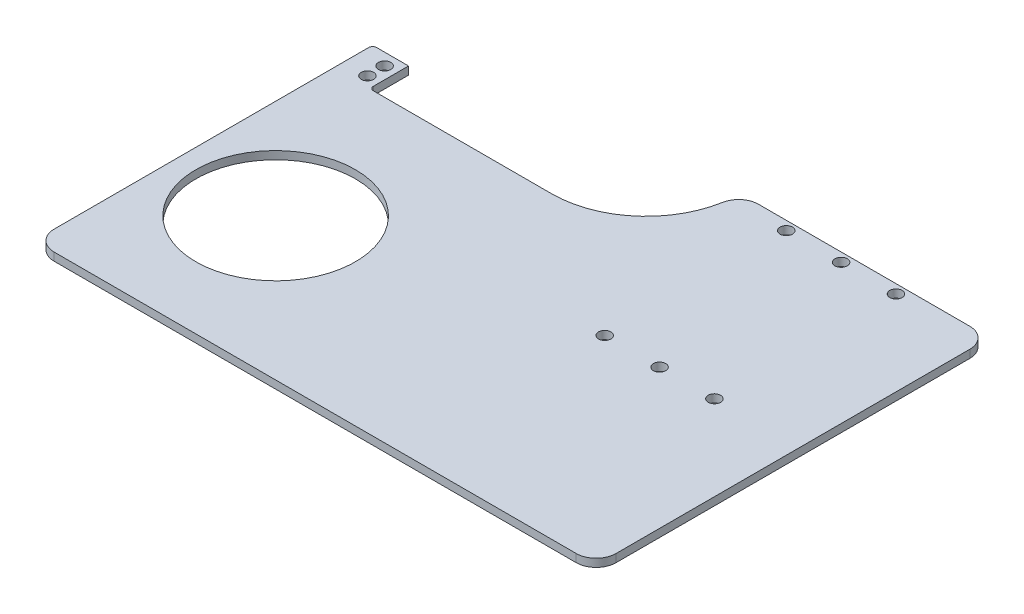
ISO-10303-21;
HEADER;
FILE_DESCRIPTION(('STEP AP214'),'2;1');
FILE_NAME('part.step','',(''),(''),'','','');
FILE_SCHEMA(('AUTOMOTIVE_DESIGN { 1 0 10303 214 1 1 1 1 }'));
ENDSEC;
DATA;
#1=APPLICATION_CONTEXT('core data for automotive mechanical design processes');
#2=APPLICATION_PROTOCOL_DEFINITION('international standard','automotive_design',2000,#1);
#3=PRODUCT_CONTEXT('',#1,'mechanical');
#4=PRODUCT('Part','Part','',(#3));
#5=PRODUCT_RELATED_PRODUCT_CATEGORY('part','',(#4));
#6=PRODUCT_DEFINITION_FORMATION('','',#4);
#7=PRODUCT_DEFINITION_CONTEXT('part definition',#1,'design');
#8=PRODUCT_DEFINITION('design','',#6,#7);
#9=PRODUCT_DEFINITION_SHAPE('','',#8);
#10=(LENGTH_UNIT() NAMED_UNIT(*) SI_UNIT(.MILLI.,.METRE.));
#11=(NAMED_UNIT(*) PLANE_ANGLE_UNIT() SI_UNIT($,.RADIAN.));
#12=(NAMED_UNIT(*) SI_UNIT($,.STERADIAN.) SOLID_ANGLE_UNIT());
#13=UNCERTAINTY_MEASURE_WITH_UNIT(LENGTH_MEASURE(1.E-05),#10,'distance_accuracy_value','');
#14=(GEOMETRIC_REPRESENTATION_CONTEXT(3) GLOBAL_UNCERTAINTY_ASSIGNED_CONTEXT((#13)) GLOBAL_UNIT_ASSIGNED_CONTEXT((#10,
#11,#12)) REPRESENTATION_CONTEXT('',''));
#15=CARTESIAN_POINT('',(0.,0.,0.));
#16=DIRECTION('',(0.,0.,1.));
#17=DIRECTION('',(1.,0.,0.));
#18=AXIS2_PLACEMENT_3D('',#15,#16,#17);
#19=CARTESIAN_POINT('',(0.,0.,0.));
#20=DIRECTION('',(0.,-1.,0.));
#21=DIRECTION('',(0.,0.,-1.));
#22=AXIS2_PLACEMENT_3D('',#19,#20,#21);
#23=PLANE('',#22);
#24=CARTESIAN_POINT('',(-5.10376942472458,0.,-14.));
#25=DIRECTION('',(0.,-1.,0.));
#26=DIRECTION('',(0.,0.,-1.));
#27=AXIS2_PLACEMENT_3D('',#24,#25,#26);
#28=CIRCLE('',#27,40.);
#29=CARTESIAN_POINT('',(-5.10376942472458,0.,-54.));
#30=VERTEX_POINT('',#29);
#31=EDGE_CURVE('E365',#30,#30,#28,.F.);
#32=ORIENTED_EDGE('',*,*,#31,.T.);
#33=EDGE_LOOP('',(#32));
#34=FACE_BOUND('',#33,.T.);
#35=CARTESIAN_POINT('',(129.342262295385,0.,-44.5));
#36=DIRECTION('',(0.,-1.,0.));
#37=DIRECTION('',(0.,0.,-1.));
#38=AXIS2_PLACEMENT_3D('',#35,#36,#37);
#39=CIRCLE('',#38,3.09999999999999);
#40=CARTESIAN_POINT('',(129.342262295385,0.,-47.6));
#41=VERTEX_POINT('',#40);
#42=EDGE_CURVE('E369',#41,#41,#39,.F.);
#43=ORIENTED_EDGE('',*,*,#42,.T.);
#44=EDGE_LOOP('',(#43));
#45=FACE_BOUND('',#44,.T.);
#46=CARTESIAN_POINT('',(156.842262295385,0.,-44.5));
#47=DIRECTION('',(0.,-1.,0.));
#48=DIRECTION('',(0.,0.,-1.));
#49=AXIS2_PLACEMENT_3D('',#46,#47,#48);
#50=CIRCLE('',#49,3.09999999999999);
#51=CARTESIAN_POINT('',(156.842262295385,0.,-47.6));
#52=VERTEX_POINT('',#51);
#53=EDGE_CURVE('E373',#52,#52,#50,.F.);
#54=ORIENTED_EDGE('',*,*,#53,.T.);
#55=EDGE_LOOP('',(#54));
#56=FACE_BOUND('',#55,.T.);
#57=CARTESIAN_POINT('',(184.342262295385,0.,-44.5));
#58=DIRECTION('',(0.,-1.,0.));
#59=DIRECTION('',(0.,0.,-1.));
#60=AXIS2_PLACEMENT_3D('',#57,#58,#59);
#61=CIRCLE('',#60,3.09999999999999);
#62=CARTESIAN_POINT('',(184.342262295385,0.,-47.6));
#63=VERTEX_POINT('',#62);
#64=EDGE_CURVE('E377',#63,#63,#61,.F.);
#65=ORIENTED_EDGE('',*,*,#64,.T.);
#66=EDGE_LOOP('',(#65));
#67=FACE_BOUND('',#66,.T.);
#68=CARTESIAN_POINT('',(184.342262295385,0.,-135.5));
#69=DIRECTION('',(0.,-1.,0.));
#70=DIRECTION('',(0.,0.,-1.));
#71=AXIS2_PLACEMENT_3D('',#68,#69,#70);
#72=CIRCLE('',#71,3.09999999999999);
#73=CARTESIAN_POINT('',(184.342262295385,0.,-138.6));
#74=VERTEX_POINT('',#73);
#75=EDGE_CURVE('E381',#74,#74,#72,.F.);
#76=ORIENTED_EDGE('',*,*,#75,.T.);
#77=EDGE_LOOP('',(#76));
#78=FACE_BOUND('',#77,.T.);
#79=CARTESIAN_POINT('',(156.842262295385,0.,-135.5));
#80=DIRECTION('',(0.,-1.,0.));
#81=DIRECTION('',(0.,0.,-1.));
#82=AXIS2_PLACEMENT_3D('',#79,#80,#81);
#83=CIRCLE('',#82,3.09999999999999);
#84=CARTESIAN_POINT('',(156.842262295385,0.,-138.6));
#85=VERTEX_POINT('',#84);
#86=EDGE_CURVE('E385',#85,#85,#83,.F.);
#87=ORIENTED_EDGE('',*,*,#86,.T.);
#88=EDGE_LOOP('',(#87));
#89=FACE_BOUND('',#88,.T.);
#90=CARTESIAN_POINT('',(129.342262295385,0.,-135.5));
#91=DIRECTION('',(0.,-1.,0.));
#92=DIRECTION('',(0.,0.,-1.));
#93=AXIS2_PLACEMENT_3D('',#90,#91,#92);
#94=CIRCLE('',#93,3.09999999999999);
#95=CARTESIAN_POINT('',(129.342262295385,0.,-138.6));
#96=VERTEX_POINT('',#95);
#97=EDGE_CURVE('E389',#96,#96,#94,.F.);
#98=ORIENTED_EDGE('',*,*,#97,.T.);
#99=EDGE_LOOP('',(#98));
#100=FACE_BOUND('',#99,.T.);
#101=CARTESIAN_POINT('',(-42.8037694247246,0.,-97.7206100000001));
#102=DIRECTION('',(0.,-1.,0.));
#103=DIRECTION('',(0.,0.,-1.));
#104=AXIS2_PLACEMENT_3D('',#101,#102,#103);
#105=CIRCLE('',#104,3.1);
#106=CARTESIAN_POINT('',(-42.8037694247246,0.,-100.82061));
#107=VERTEX_POINT('',#106);
#108=EDGE_CURVE('E393',#107,#107,#105,.F.);
#109=ORIENTED_EDGE('',*,*,#108,.T.);
#110=EDGE_LOOP('',(#109));
#111=FACE_BOUND('',#110,.T.);
#112=CARTESIAN_POINT('',(-42.8037694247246,0.,-106.32061));
#113=DIRECTION('',(0.,-1.,0.));
#114=DIRECTION('',(0.,0.,-1.));
#115=AXIS2_PLACEMENT_3D('',#112,#113,#114);
#116=CIRCLE('',#115,3.1);
#117=CARTESIAN_POINT('',(-42.8037694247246,0.,-109.42061));
#118=VERTEX_POINT('',#117);
#119=EDGE_CURVE('E208',#118,#118,#116,.F.);
#120=ORIENTED_EDGE('',*,*,#119,.T.);
#121=EDGE_LOOP('',(#120));
#122=FACE_BOUND('',#121,.T.);
#123=CARTESIAN_POINT('',(-44.8037694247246,0.,47.2949));
#124=DIRECTION('',(0.,-1.,0.));
#125=DIRECTION('',(0.,0.,-1.));
#126=AXIS2_PLACEMENT_3D('',#123,#124,#125);
#127=CIRCLE('',#126,9.99999999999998);
#128=CARTESIAN_POINT('',(-44.8037694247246,0.,57.2949));
#129=VERTEX_POINT('',#128);
#130=CARTESIAN_POINT('',(-54.8037694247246,0.,47.2949));
#131=VERTEX_POINT('',#130);
#132=EDGE_CURVE('E109',#129,#131,#127,.T.);
#133=ORIENTED_EDGE('',*,*,#132,.T.);
#134=DIRECTION('',(0.,0.,-1.));
#135=VECTOR('',#134,1.);
#136=CARTESIAN_POINT('',(-54.8037694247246,0.,47.2949));
#137=LINE('',#136,#135);
#138=CARTESIAN_POINT('',(-54.8037694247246,0.,-110.32061));
#139=VERTEX_POINT('',#138);
#140=EDGE_CURVE('E192',#131,#139,#137,.T.);
#141=ORIENTED_EDGE('',*,*,#140,.T.);
#142=CARTESIAN_POINT('',(-52.8037694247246,0.,-110.32061));
#143=DIRECTION('',(0.,1.,0.));
#144=DIRECTION('',(0.,0.,1.));
#145=AXIS2_PLACEMENT_3D('',#142,#143,#144);
#146=CIRCLE('',#145,2.);
#147=CARTESIAN_POINT('',(-52.8037694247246,0.,-112.32061));
#148=VERTEX_POINT('',#147);
#149=EDGE_CURVE('E197',#148,#139,#146,.T.);
#150=ORIENTED_EDGE('',*,*,#149,.F.);
#151=DIRECTION('',(1.,0.,0.));
#152=VECTOR('',#151,1.);
#153=CARTESIAN_POINT('',(-52.8037694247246,0.,-112.32061));
#154=LINE('',#153,#152);
#155=CARTESIAN_POINT('',(-36.8037694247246,0.,-112.32061));
#156=VERTEX_POINT('',#155);
#157=EDGE_CURVE('E212',#148,#156,#154,.T.);
#158=ORIENTED_EDGE('',*,*,#157,.T.);
#159=DIRECTION('',(0.,0.,1.));
#160=VECTOR('',#159,1.);
#161=CARTESIAN_POINT('',(-36.8037694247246,0.,-112.32061));
#162=LINE('',#161,#160);
#163=CARTESIAN_POINT('',(-36.8037694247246,0.,-94.7051000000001));
#164=VERTEX_POINT('',#163);
#165=EDGE_CURVE('E215',#156,#164,#162,.T.);
#166=ORIENTED_EDGE('',*,*,#165,.T.);
#167=CARTESIAN_POINT('',(-34.8037694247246,0.,-94.7051000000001));
#168=DIRECTION('',(0.,1.,0.));
#169=DIRECTION('',(0.,0.,1.));
#170=AXIS2_PLACEMENT_3D('',#167,#168,#169);
#171=CIRCLE('',#170,2.);
#172=CARTESIAN_POINT('',(-34.8037694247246,0.,-92.7051000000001));
#173=VERTEX_POINT('',#172);
#174=EDGE_CURVE('E218',#164,#173,#171,.T.);
#175=ORIENTED_EDGE('',*,*,#174,.T.);
#176=DIRECTION('',(1.,0.,0.));
#177=VECTOR('',#176,1.);
#178=CARTESIAN_POINT('',(-34.8037694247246,0.,-92.7051000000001));
#179=LINE('',#178,#177);
#180=CARTESIAN_POINT('',(54.5473622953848,0.,-92.7051000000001));
#181=VERTEX_POINT('',#180);
#182=EDGE_CURVE('E221',#173,#181,#179,.T.);
#183=ORIENTED_EDGE('',*,*,#182,.T.);
#184=CARTESIAN_POINT('',(54.5473622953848,0.,-140.));
#185=DIRECTION('',(0.,1.,0.));
#186=DIRECTION('',(0.,0.,1.));
#187=AXIS2_PLACEMENT_3D('',#184,#185,#186);
#188=CIRCLE('',#187,47.2949);
#189=CARTESIAN_POINT('',(101.116326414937,0.,-131.745356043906));
#190=VERTEX_POINT('',#189);
#191=EDGE_CURVE('E224',#181,#190,#188,.T.);
#192=ORIENTED_EDGE('',*,*,#191,.T.);
#193=CARTESIAN_POINT('',(110.962835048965,0.,-130.));
#194=DIRECTION('',(0.,-1.,0.));
#195=DIRECTION('',(0.,0.,-1.));
#196=AXIS2_PLACEMENT_3D('',#193,#194,#195);
#197=CIRCLE('',#196,10.);
#198=CARTESIAN_POINT('',(110.962835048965,0.,-140.));
#199=VERTEX_POINT('',#198);
#200=EDGE_CURVE('E227',#190,#199,#197,.T.);
#201=ORIENTED_EDGE('',*,*,#200,.T.);
#202=DIRECTION('',(1.,0.,0.));
#203=VECTOR('',#202,1.);
#204=CARTESIAN_POINT('',(110.962835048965,0.,-140.));
#205=LINE('',#204,#203);
#206=CARTESIAN_POINT('',(216.842262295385,0.,-140.));
#207=VERTEX_POINT('',#206);
#208=EDGE_CURVE('E230',#199,#207,#205,.T.);
#209=ORIENTED_EDGE('',*,*,#208,.T.);
#210=CARTESIAN_POINT('',(216.842262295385,0.,-130.));
#211=DIRECTION('',(0.,-1.,0.));
#212=DIRECTION('',(0.,0.,-1.));
#213=AXIS2_PLACEMENT_3D('',#210,#211,#212);
#214=CIRCLE('',#213,10.);
#215=CARTESIAN_POINT('',(226.842262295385,0.,-130.));
#216=VERTEX_POINT('',#215);
#217=EDGE_CURVE('E233',#207,#216,#214,.T.);
#218=ORIENTED_EDGE('',*,*,#217,.T.);
#219=DIRECTION('',(0.,0.,1.));
#220=VECTOR('',#219,1.);
#221=CARTESIAN_POINT('',(226.842262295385,0.,-130.));
#222=LINE('',#221,#220);
#223=CARTESIAN_POINT('',(226.842262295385,0.,47.2948999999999));
#224=VERTEX_POINT('',#223);
#225=EDGE_CURVE('E236',#216,#224,#222,.T.);
#226=ORIENTED_EDGE('',*,*,#225,.T.);
#227=CARTESIAN_POINT('',(216.842262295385,0.,47.2948999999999));
#228=DIRECTION('',(0.,-1.,0.));
#229=DIRECTION('',(0.,0.,-1.));
#230=AXIS2_PLACEMENT_3D('',#227,#228,#229);
#231=CIRCLE('',#230,10.);
#232=CARTESIAN_POINT('',(216.842262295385,0.,57.2948999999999));
#233=VERTEX_POINT('',#232);
#234=EDGE_CURVE('E239',#224,#233,#231,.T.);
#235=ORIENTED_EDGE('',*,*,#234,.T.);
#236=DIRECTION('',(-1.,0.,0.));
#237=VECTOR('',#236,1.);
#238=CARTESIAN_POINT('',(216.842262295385,0.,57.2948999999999));
#239=LINE('',#238,#237);
#240=EDGE_CURVE('E202',#233,#129,#239,.T.);
#241=ORIENTED_EDGE('',*,*,#240,.T.);
#242=EDGE_LOOP('',(#133,#141,#150,#158,#166,#175,#183,#192,#201,#209,#218,#226,#235,#241));
#243=FACE_BOUND('',#242,.T.);
#244=ADVANCED_FACE('F87',(#34,#45,#56,#67,#78,#89,#100,#111,#122,#243),#23,.T.);
#245=CARTESIAN_POINT('',(-44.8037694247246,0.,47.2949));
#246=DIRECTION('',(0.,1.,0.));
#247=DIRECTION('',(0.,0.,1.));
#248=AXIS2_PLACEMENT_3D('',#245,#246,#247);
#249=CYLINDRICAL_SURFACE('',#248,9.99999999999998);
#250=CARTESIAN_POINT('',(-44.8037694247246,4.,47.2949));
#251=DIRECTION('',(0.,-1.,0.));
#252=DIRECTION('',(0.,0.,-1.));
#253=AXIS2_PLACEMENT_3D('',#250,#251,#252);
#254=CIRCLE('',#253,9.99999999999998);
#255=CARTESIAN_POINT('',(-44.8037694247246,4.,57.2949));
#256=VERTEX_POINT('',#255);
#257=CARTESIAN_POINT('',(-54.8037694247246,4.,47.2949));
#258=VERTEX_POINT('',#257);
#259=EDGE_CURVE('E187',#256,#258,#254,.T.);
#260=ORIENTED_EDGE('',*,*,#259,.T.);
#261=DIRECTION('',(0.,1.,0.));
#262=VECTOR('',#261,1.);
#263=CARTESIAN_POINT('',(-54.8037694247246,0.,47.2949));
#264=LINE('',#263,#262);
#265=EDGE_CURVE('E12',#131,#258,#264,.T.);
#266=ORIENTED_EDGE('',*,*,#265,.F.);
#267=ORIENTED_EDGE('',*,*,#132,.F.);
#268=DIRECTION('',(0.,1.,0.));
#269=VECTOR('',#268,1.);
#270=CARTESIAN_POINT('',(-44.8037694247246,0.,57.2949));
#271=LINE('',#270,#269);
#272=EDGE_CURVE('E242',#129,#256,#271,.T.);
#273=ORIENTED_EDGE('',*,*,#272,.T.);
#274=EDGE_LOOP('',(#260,#266,#267,#273));
#275=FACE_BOUND('',#274,.T.);
#276=ADVANCED_FACE('F185',(#275),#249,.T.);
#277=CARTESIAN_POINT('',(-54.8037694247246,0.,47.2949));
#278=DIRECTION('',(1.,0.,0.));
#279=DIRECTION('',(0.,0.,-1.));
#280=AXIS2_PLACEMENT_3D('',#277,#278,#279);
#281=PLANE('',#280);
#282=DIRECTION('',(0.,0.,-1.));
#283=VECTOR('',#282,1.);
#284=CARTESIAN_POINT('',(-54.8037694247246,4.,47.2949));
#285=LINE('',#284,#283);
#286=CARTESIAN_POINT('',(-54.8037694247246,4.,-110.32061));
#287=VERTEX_POINT('',#286);
#288=EDGE_CURVE('E244',#258,#287,#285,.T.);
#289=ORIENTED_EDGE('',*,*,#288,.T.);
#290=DIRECTION('',(0.,1.,0.));
#291=VECTOR('',#290,1.);
#292=CARTESIAN_POINT('',(-54.8037694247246,0.,-110.32061));
#293=LINE('',#292,#291);
#294=EDGE_CURVE('E94',#139,#287,#293,.T.);
#295=ORIENTED_EDGE('',*,*,#294,.F.);
#296=ORIENTED_EDGE('',*,*,#140,.F.);
#297=ORIENTED_EDGE('',*,*,#265,.T.);
#298=EDGE_LOOP('',(#289,#295,#296,#297));
#299=FACE_BOUND('',#298,.T.);
#300=ADVANCED_FACE('F193',(#299),#281,.F.);
#301=CARTESIAN_POINT('',(-52.8037694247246,0.,-110.32061));
#302=DIRECTION('',(0.,1.,0.));
#303=DIRECTION('',(0.,0.,1.));
#304=AXIS2_PLACEMENT_3D('',#301,#302,#303);
#305=CYLINDRICAL_SURFACE('',#304,2.);
#306=CARTESIAN_POINT('',(-52.8037694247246,4.,-110.32061));
#307=DIRECTION('',(0.,1.,0.));
#308=DIRECTION('',(0.,0.,1.));
#309=AXIS2_PLACEMENT_3D('',#306,#307,#308);
#310=CIRCLE('',#309,2.);
#311=CARTESIAN_POINT('',(-52.8037694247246,4.,-112.32061));
#312=VERTEX_POINT('',#311);
#313=EDGE_CURVE('E247',#312,#287,#310,.T.);
#314=ORIENTED_EDGE('',*,*,#313,.F.);
#315=DIRECTION('',(0.,1.,0.));
#316=VECTOR('',#315,1.);
#317=CARTESIAN_POINT('',(-52.8037694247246,0.,-112.32061));
#318=LINE('',#317,#316);
#319=EDGE_CURVE('E299',#148,#312,#318,.T.);
#320=ORIENTED_EDGE('',*,*,#319,.F.);
#321=ORIENTED_EDGE('',*,*,#149,.T.);
#322=ORIENTED_EDGE('',*,*,#294,.T.);
#323=EDGE_LOOP('',(#314,#320,#321,#322));
#324=FACE_BOUND('',#323,.T.);
#325=ADVANCED_FACE('F302',(#324),#305,.T.);
#326=CARTESIAN_POINT('',(-52.8037694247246,0.,-112.32061));
#327=DIRECTION('',(0.,0.,1.));
#328=DIRECTION('',(1.,0.,0.));
#329=AXIS2_PLACEMENT_3D('',#326,#327,#328);
#330=PLANE('',#329);
#331=DIRECTION('',(1.,0.,0.));
#332=VECTOR('',#331,1.);
#333=CARTESIAN_POINT('',(-52.8037694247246,4.,-112.32061));
#334=LINE('',#333,#332);
#335=CARTESIAN_POINT('',(-36.8037694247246,4.,-112.32061));
#336=VERTEX_POINT('',#335);
#337=EDGE_CURVE('E250',#312,#336,#334,.T.);
#338=ORIENTED_EDGE('',*,*,#337,.T.);
#339=DIRECTION('',(0.,1.,0.));
#340=VECTOR('',#339,1.);
#341=CARTESIAN_POINT('',(-36.8037694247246,0.,-112.32061));
#342=LINE('',#341,#340);
#343=EDGE_CURVE('E297',#156,#336,#342,.T.);
#344=ORIENTED_EDGE('',*,*,#343,.F.);
#345=ORIENTED_EDGE('',*,*,#157,.F.);
#346=ORIENTED_EDGE('',*,*,#319,.T.);
#347=EDGE_LOOP('',(#338,#344,#345,#346));
#348=FACE_BOUND('',#347,.T.);
#349=ADVANCED_FACE('F309',(#348),#330,.F.);
#350=CARTESIAN_POINT('',(-36.8037694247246,0.,-112.32061));
#351=DIRECTION('',(-1.,0.,0.));
#352=DIRECTION('',(0.,0.,1.));
#353=AXIS2_PLACEMENT_3D('',#350,#351,#352);
#354=PLANE('',#353);
#355=DIRECTION('',(0.,0.,1.));
#356=VECTOR('',#355,1.);
#357=CARTESIAN_POINT('',(-36.8037694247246,4.,-112.32061));
#358=LINE('',#357,#356);
#359=CARTESIAN_POINT('',(-36.8037694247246,4.,-94.7051000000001));
#360=VERTEX_POINT('',#359);
#361=EDGE_CURVE('E253',#336,#360,#358,.T.);
#362=ORIENTED_EDGE('',*,*,#361,.T.);
#363=DIRECTION('',(0.,1.,0.));
#364=VECTOR('',#363,1.);
#365=CARTESIAN_POINT('',(-36.8037694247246,0.,-94.7051000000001));
#366=LINE('',#365,#364);
#367=EDGE_CURVE('E295',#164,#360,#366,.T.);
#368=ORIENTED_EDGE('',*,*,#367,.F.);
#369=ORIENTED_EDGE('',*,*,#165,.F.);
#370=ORIENTED_EDGE('',*,*,#343,.T.);
#371=EDGE_LOOP('',(#362,#368,#369,#370));
#372=FACE_BOUND('',#371,.T.);
#373=ADVANCED_FACE('F314',(#372),#354,.F.);
#374=CARTESIAN_POINT('',(-34.8037694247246,0.,-94.7051000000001));
#375=DIRECTION('',(0.,1.,0.));
#376=DIRECTION('',(0.,0.,1.));
#377=AXIS2_PLACEMENT_3D('',#374,#375,#376);
#378=CYLINDRICAL_SURFACE('',#377,2.);
#379=CARTESIAN_POINT('',(-34.8037694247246,4.,-94.7051000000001));
#380=DIRECTION('',(0.,1.,0.));
#381=DIRECTION('',(0.,0.,1.));
#382=AXIS2_PLACEMENT_3D('',#379,#380,#381);
#383=CIRCLE('',#382,2.);
#384=CARTESIAN_POINT('',(-34.8037694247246,4.,-92.7051000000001));
#385=VERTEX_POINT('',#384);
#386=EDGE_CURVE('E256',#360,#385,#383,.T.);
#387=ORIENTED_EDGE('',*,*,#386,.T.);
#388=DIRECTION('',(0.,1.,0.));
#389=VECTOR('',#388,1.);
#390=CARTESIAN_POINT('',(-34.8037694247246,0.,-92.7051000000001));
#391=LINE('',#390,#389);
#392=EDGE_CURVE('E293',#173,#385,#391,.T.);
#393=ORIENTED_EDGE('',*,*,#392,.F.);
#394=ORIENTED_EDGE('',*,*,#174,.F.);
#395=ORIENTED_EDGE('',*,*,#367,.T.);
#396=EDGE_LOOP('',(#387,#393,#394,#395));
#397=FACE_BOUND('',#396,.T.);
#398=ADVANCED_FACE('F316',(#397),#378,.F.);
#399=CARTESIAN_POINT('',(-34.8037694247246,0.,-92.7051000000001));
#400=DIRECTION('',(0.,0.,1.));
#401=DIRECTION('',(1.,0.,0.));
#402=AXIS2_PLACEMENT_3D('',#399,#400,#401);
#403=PLANE('',#402);
#404=DIRECTION('',(1.,0.,0.));
#405=VECTOR('',#404,1.);
#406=CARTESIAN_POINT('',(-34.8037694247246,4.,-92.7051000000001));
#407=LINE('',#406,#405);
#408=CARTESIAN_POINT('',(54.5473622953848,4.,-92.7051000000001));
#409=VERTEX_POINT('',#408);
#410=EDGE_CURVE('E259',#385,#409,#407,.T.);
#411=ORIENTED_EDGE('',*,*,#410,.T.);
#412=DIRECTION('',(0.,1.,0.));
#413=VECTOR('',#412,1.);
#414=CARTESIAN_POINT('',(54.5473622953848,0.,-92.7051000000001));
#415=LINE('',#414,#413);
#416=EDGE_CURVE('E291',#181,#409,#415,.T.);
#417=ORIENTED_EDGE('',*,*,#416,.F.);
#418=ORIENTED_EDGE('',*,*,#182,.F.);
#419=ORIENTED_EDGE('',*,*,#392,.T.);
#420=EDGE_LOOP('',(#411,#417,#418,#419));
#421=FACE_BOUND('',#420,.T.);
#422=ADVANCED_FACE('F320',(#421),#403,.F.);
#423=CARTESIAN_POINT('',(54.5473622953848,0.,-140.));
#424=DIRECTION('',(0.,1.,0.));
#425=DIRECTION('',(0.,0.,1.));
#426=AXIS2_PLACEMENT_3D('',#423,#424,#425);
#427=CYLINDRICAL_SURFACE('',#426,47.2949);
#428=CARTESIAN_POINT('',(54.5473622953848,4.,-140.));
#429=DIRECTION('',(0.,1.,0.));
#430=DIRECTION('',(0.,0.,1.));
#431=AXIS2_PLACEMENT_3D('',#428,#429,#430);
#432=CIRCLE('',#431,47.2949);
#433=CARTESIAN_POINT('',(101.116326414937,4.,-131.745356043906));
#434=VERTEX_POINT('',#433);
#435=EDGE_CURVE('E262',#409,#434,#432,.T.);
#436=ORIENTED_EDGE('',*,*,#435,.T.);
#437=DIRECTION('',(0.,1.,0.));
#438=VECTOR('',#437,1.);
#439=CARTESIAN_POINT('',(101.116326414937,0.,-131.745356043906));
#440=LINE('',#439,#438);
#441=EDGE_CURVE('E289',#190,#434,#440,.T.);
#442=ORIENTED_EDGE('',*,*,#441,.F.);
#443=ORIENTED_EDGE('',*,*,#191,.F.);
#444=ORIENTED_EDGE('',*,*,#416,.T.);
#445=EDGE_LOOP('',(#436,#442,#443,#444));
#446=FACE_BOUND('',#445,.T.);
#447=ADVANCED_FACE('F324',(#446),#427,.F.);
#448=CARTESIAN_POINT('',(110.962835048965,0.,-130.));
#449=DIRECTION('',(0.,1.,0.));
#450=DIRECTION('',(0.,0.,1.));
#451=AXIS2_PLACEMENT_3D('',#448,#449,#450);
#452=CYLINDRICAL_SURFACE('',#451,10.);
#453=CARTESIAN_POINT('',(110.962835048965,4.,-130.));
#454=DIRECTION('',(0.,-1.,0.));
#455=DIRECTION('',(0.,0.,-1.));
#456=AXIS2_PLACEMENT_3D('',#453,#454,#455);
#457=CIRCLE('',#456,10.);
#458=CARTESIAN_POINT('',(110.962835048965,4.,-140.));
#459=VERTEX_POINT('',#458);
#460=EDGE_CURVE('E265',#434,#459,#457,.T.);
#461=ORIENTED_EDGE('',*,*,#460,.T.);
#462=DIRECTION('',(0.,1.,0.));
#463=VECTOR('',#462,1.);
#464=CARTESIAN_POINT('',(110.962835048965,0.,-140.));
#465=LINE('',#464,#463);
#466=EDGE_CURVE('E287',#199,#459,#465,.T.);
#467=ORIENTED_EDGE('',*,*,#466,.F.);
#468=ORIENTED_EDGE('',*,*,#200,.F.);
#469=ORIENTED_EDGE('',*,*,#441,.T.);
#470=EDGE_LOOP('',(#461,#467,#468,#469));
#471=FACE_BOUND('',#470,.T.);
#472=ADVANCED_FACE('F328',(#471),#452,.T.);
#473=CARTESIAN_POINT('',(110.962835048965,0.,-140.));
#474=DIRECTION('',(0.,0.,1.));
#475=DIRECTION('',(1.,0.,0.));
#476=AXIS2_PLACEMENT_3D('',#473,#474,#475);
#477=PLANE('',#476);
#478=DIRECTION('',(1.,0.,0.));
#479=VECTOR('',#478,1.);
#480=CARTESIAN_POINT('',(110.962835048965,4.,-140.));
#481=LINE('',#480,#479);
#482=CARTESIAN_POINT('',(216.842262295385,4.,-140.));
#483=VERTEX_POINT('',#482);
#484=EDGE_CURVE('E268',#459,#483,#481,.T.);
#485=ORIENTED_EDGE('',*,*,#484,.T.);
#486=DIRECTION('',(0.,1.,0.));
#487=VECTOR('',#486,1.);
#488=CARTESIAN_POINT('',(216.842262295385,0.,-140.));
#489=LINE('',#488,#487);
#490=EDGE_CURVE('E285',#207,#483,#489,.T.);
#491=ORIENTED_EDGE('',*,*,#490,.F.);
#492=ORIENTED_EDGE('',*,*,#208,.F.);
#493=ORIENTED_EDGE('',*,*,#466,.T.);
#494=EDGE_LOOP('',(#485,#491,#492,#493));
#495=FACE_BOUND('',#494,.T.);
#496=ADVANCED_FACE('F332',(#495),#477,.F.);
#497=CARTESIAN_POINT('',(216.842262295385,0.,-130.));
#498=DIRECTION('',(0.,1.,0.));
#499=DIRECTION('',(0.,0.,1.));
#500=AXIS2_PLACEMENT_3D('',#497,#498,#499);
#501=CYLINDRICAL_SURFACE('',#500,10.);
#502=CARTESIAN_POINT('',(216.842262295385,4.,-130.));
#503=DIRECTION('',(0.,-1.,0.));
#504=DIRECTION('',(0.,0.,-1.));
#505=AXIS2_PLACEMENT_3D('',#502,#503,#504);
#506=CIRCLE('',#505,10.);
#507=CARTESIAN_POINT('',(226.842262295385,4.,-130.));
#508=VERTEX_POINT('',#507);
#509=EDGE_CURVE('E271',#483,#508,#506,.T.);
#510=ORIENTED_EDGE('',*,*,#509,.T.);
#511=DIRECTION('',(0.,1.,0.));
#512=VECTOR('',#511,1.);
#513=CARTESIAN_POINT('',(226.842262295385,0.,-130.));
#514=LINE('',#513,#512);
#515=EDGE_CURVE('E283',#216,#508,#514,.T.);
#516=ORIENTED_EDGE('',*,*,#515,.F.);
#517=ORIENTED_EDGE('',*,*,#217,.F.);
#518=ORIENTED_EDGE('',*,*,#490,.T.);
#519=EDGE_LOOP('',(#510,#516,#517,#518));
#520=FACE_BOUND('',#519,.T.);
#521=ADVANCED_FACE('F336',(#520),#501,.T.);
#522=CARTESIAN_POINT('',(226.842262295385,0.,-130.));
#523=DIRECTION('',(-1.,0.,0.));
#524=DIRECTION('',(0.,0.,1.));
#525=AXIS2_PLACEMENT_3D('',#522,#523,#524);
#526=PLANE('',#525);
#527=DIRECTION('',(0.,0.,1.));
#528=VECTOR('',#527,1.);
#529=CARTESIAN_POINT('',(226.842262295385,4.,-130.));
#530=LINE('',#529,#528);
#531=CARTESIAN_POINT('',(226.842262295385,4.,47.2948999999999));
#532=VERTEX_POINT('',#531);
#533=EDGE_CURVE('E274',#508,#532,#530,.T.);
#534=ORIENTED_EDGE('',*,*,#533,.T.);
#535=DIRECTION('',(0.,1.,0.));
#536=VECTOR('',#535,1.);
#537=CARTESIAN_POINT('',(226.842262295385,0.,47.2948999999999));
#538=LINE('',#537,#536);
#539=EDGE_CURVE('E281',#224,#532,#538,.T.);
#540=ORIENTED_EDGE('',*,*,#539,.F.);
#541=ORIENTED_EDGE('',*,*,#225,.F.);
#542=ORIENTED_EDGE('',*,*,#515,.T.);
#543=EDGE_LOOP('',(#534,#540,#541,#542));
#544=FACE_BOUND('',#543,.T.);
#545=ADVANCED_FACE('F340',(#544),#526,.F.);
#546=CARTESIAN_POINT('',(216.842262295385,0.,47.2948999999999));
#547=DIRECTION('',(0.,1.,0.));
#548=DIRECTION('',(0.,0.,1.));
#549=AXIS2_PLACEMENT_3D('',#546,#547,#548);
#550=CYLINDRICAL_SURFACE('',#549,10.);
#551=CARTESIAN_POINT('',(216.842262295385,4.,47.2948999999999));
#552=DIRECTION('',(0.,-1.,0.));
#553=DIRECTION('',(0.,0.,-1.));
#554=AXIS2_PLACEMENT_3D('',#551,#552,#553);
#555=CIRCLE('',#554,10.);
#556=CARTESIAN_POINT('',(216.842262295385,4.,57.2948999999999));
#557=VERTEX_POINT('',#556);
#558=EDGE_CURVE('E101',#532,#557,#555,.T.);
#559=ORIENTED_EDGE('',*,*,#558,.T.);
#560=DIRECTION('',(0.,1.,0.));
#561=VECTOR('',#560,1.);
#562=CARTESIAN_POINT('',(216.842262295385,0.,57.2948999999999));
#563=LINE('',#562,#561);
#564=EDGE_CURVE('E279',#233,#557,#563,.T.);
#565=ORIENTED_EDGE('',*,*,#564,.F.);
#566=ORIENTED_EDGE('',*,*,#234,.F.);
#567=ORIENTED_EDGE('',*,*,#539,.T.);
#568=EDGE_LOOP('',(#559,#565,#566,#567));
#569=FACE_BOUND('',#568,.T.);
#570=ADVANCED_FACE('F342',(#569),#550,.T.);
#571=CARTESIAN_POINT('',(216.842262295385,0.,57.2948999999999));
#572=DIRECTION('',(0.,0.,-1.));
#573=DIRECTION('',(-1.,0.,0.));
#574=AXIS2_PLACEMENT_3D('',#571,#572,#573);
#575=PLANE('',#574);
#576=DIRECTION('',(-1.,0.,0.));
#577=VECTOR('',#576,1.);
#578=CARTESIAN_POINT('',(216.842262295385,4.,57.2948999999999));
#579=LINE('',#578,#577);
#580=EDGE_CURVE('E203',#557,#256,#579,.T.);
#581=ORIENTED_EDGE('',*,*,#580,.T.);
#582=ORIENTED_EDGE('',*,*,#272,.F.);
#583=ORIENTED_EDGE('',*,*,#240,.F.);
#584=ORIENTED_EDGE('',*,*,#564,.T.);
#585=EDGE_LOOP('',(#581,#582,#583,#584));
#586=FACE_BOUND('',#585,.T.);
#587=ADVANCED_FACE('F345',(#586),#575,.F.);
#588=CARTESIAN_POINT('',(0.,4.,0.));
#589=DIRECTION('',(0.,-1.,0.));
#590=DIRECTION('',(0.,0.,-1.));
#591=AXIS2_PLACEMENT_3D('',#588,#589,#590);
#592=PLANE('',#591);
#593=CARTESIAN_POINT('',(-5.10376942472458,4.,-14.));
#594=DIRECTION('',(0.,1.,0.));
#595=DIRECTION('',(0.,0.,1.));
#596=AXIS2_PLACEMENT_3D('',#593,#594,#595);
#597=CIRCLE('',#596,40.);
#598=CARTESIAN_POINT('',(-5.10376942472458,4.,26.));
#599=VERTEX_POINT('',#598);
#600=EDGE_CURVE('E429',#599,#599,#597,.T.);
#601=ORIENTED_EDGE('',*,*,#600,.F.);
#602=EDGE_LOOP('',(#601));
#603=FACE_BOUND('',#602,.T.);
#604=CARTESIAN_POINT('',(129.342262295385,4.,-44.5));
#605=DIRECTION('',(0.,1.,0.));
#606=DIRECTION('',(0.,0.,1.));
#607=AXIS2_PLACEMENT_3D('',#604,#605,#606);
#608=CIRCLE('',#607,3.09999999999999);
#609=CARTESIAN_POINT('',(129.342262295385,4.,-41.4));
#610=VERTEX_POINT('',#609);
#611=EDGE_CURVE('E425',#610,#610,#608,.T.);
#612=ORIENTED_EDGE('',*,*,#611,.F.);
#613=EDGE_LOOP('',(#612));
#614=FACE_BOUND('',#613,.T.);
#615=CARTESIAN_POINT('',(156.842262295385,4.,-44.5));
#616=DIRECTION('',(0.,1.,0.));
#617=DIRECTION('',(0.,0.,1.));
#618=AXIS2_PLACEMENT_3D('',#615,#616,#617);
#619=CIRCLE('',#618,3.09999999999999);
#620=CARTESIAN_POINT('',(156.842262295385,4.,-41.4));
#621=VERTEX_POINT('',#620);
#622=EDGE_CURVE('E421',#621,#621,#619,.T.);
#623=ORIENTED_EDGE('',*,*,#622,.F.);
#624=EDGE_LOOP('',(#623));
#625=FACE_BOUND('',#624,.T.);
#626=CARTESIAN_POINT('',(184.342262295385,4.,-44.5));
#627=DIRECTION('',(0.,1.,0.));
#628=DIRECTION('',(0.,0.,1.));
#629=AXIS2_PLACEMENT_3D('',#626,#627,#628);
#630=CIRCLE('',#629,3.09999999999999);
#631=CARTESIAN_POINT('',(184.342262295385,4.,-41.4));
#632=VERTEX_POINT('',#631);
#633=EDGE_CURVE('E417',#632,#632,#630,.T.);
#634=ORIENTED_EDGE('',*,*,#633,.F.);
#635=EDGE_LOOP('',(#634));
#636=FACE_BOUND('',#635,.T.);
#637=CARTESIAN_POINT('',(184.342262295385,4.,-135.5));
#638=DIRECTION('',(0.,1.,0.));
#639=DIRECTION('',(0.,0.,1.));
#640=AXIS2_PLACEMENT_3D('',#637,#638,#639);
#641=CIRCLE('',#640,3.09999999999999);
#642=CARTESIAN_POINT('',(184.342262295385,4.,-132.4));
#643=VERTEX_POINT('',#642);
#644=EDGE_CURVE('E413',#643,#643,#641,.T.);
#645=ORIENTED_EDGE('',*,*,#644,.F.);
#646=EDGE_LOOP('',(#645));
#647=FACE_BOUND('',#646,.T.);
#648=CARTESIAN_POINT('',(156.842262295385,4.,-135.5));
#649=DIRECTION('',(0.,1.,0.));
#650=DIRECTION('',(0.,0.,1.));
#651=AXIS2_PLACEMENT_3D('',#648,#649,#650);
#652=CIRCLE('',#651,3.09999999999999);
#653=CARTESIAN_POINT('',(156.842262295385,4.,-132.4));
#654=VERTEX_POINT('',#653);
#655=EDGE_CURVE('E409',#654,#654,#652,.T.);
#656=ORIENTED_EDGE('',*,*,#655,.F.);
#657=EDGE_LOOP('',(#656));
#658=FACE_BOUND('',#657,.T.);
#659=CARTESIAN_POINT('',(129.342262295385,4.,-135.5));
#660=DIRECTION('',(0.,1.,0.));
#661=DIRECTION('',(0.,0.,1.));
#662=AXIS2_PLACEMENT_3D('',#659,#660,#661);
#663=CIRCLE('',#662,3.09999999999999);
#664=CARTESIAN_POINT('',(129.342262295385,4.,-132.4));
#665=VERTEX_POINT('',#664);
#666=EDGE_CURVE('E403',#665,#665,#663,.T.);
#667=ORIENTED_EDGE('',*,*,#666,.F.);
#668=EDGE_LOOP('',(#667));
#669=FACE_BOUND('',#668,.T.);
#670=CARTESIAN_POINT('',(-42.8037694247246,4.,-97.7206100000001));
#671=DIRECTION('',(0.,1.,0.));
#672=DIRECTION('',(0.,0.,1.));
#673=AXIS2_PLACEMENT_3D('',#670,#671,#672);
#674=CIRCLE('',#673,3.1);
#675=CARTESIAN_POINT('',(-42.8037694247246,4.,-94.6206100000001));
#676=VERTEX_POINT('',#675);
#677=EDGE_CURVE('E397',#676,#676,#674,.T.);
#678=ORIENTED_EDGE('',*,*,#677,.F.);
#679=EDGE_LOOP('',(#678));
#680=FACE_BOUND('',#679,.T.);
#681=CARTESIAN_POINT('',(-42.8037694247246,4.,-106.32061));
#682=DIRECTION('',(0.,1.,0.));
#683=DIRECTION('',(0.,0.,1.));
#684=AXIS2_PLACEMENT_3D('',#681,#682,#683);
#685=CIRCLE('',#684,3.1);
#686=CARTESIAN_POINT('',(-42.8037694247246,4.,-103.22061));
#687=VERTEX_POINT('',#686);
#688=EDGE_CURVE('E245',#687,#687,#685,.T.);
#689=ORIENTED_EDGE('',*,*,#688,.F.);
#690=EDGE_LOOP('',(#689));
#691=FACE_BOUND('',#690,.T.);
#692=ORIENTED_EDGE('',*,*,#288,.F.);
#693=ORIENTED_EDGE('',*,*,#259,.F.);
#694=ORIENTED_EDGE('',*,*,#580,.F.);
#695=ORIENTED_EDGE('',*,*,#558,.F.);
#696=ORIENTED_EDGE('',*,*,#533,.F.);
#697=ORIENTED_EDGE('',*,*,#509,.F.);
#698=ORIENTED_EDGE('',*,*,#484,.F.);
#699=ORIENTED_EDGE('',*,*,#460,.F.);
#700=ORIENTED_EDGE('',*,*,#435,.F.);
#701=ORIENTED_EDGE('',*,*,#410,.F.);
#702=ORIENTED_EDGE('',*,*,#386,.F.);
#703=ORIENTED_EDGE('',*,*,#361,.F.);
#704=ORIENTED_EDGE('',*,*,#337,.F.);
#705=ORIENTED_EDGE('',*,*,#313,.T.);
#706=EDGE_LOOP('',(#692,#693,#694,#695,#696,#697,#698,#699,#700,#701,#702,#703,#704,#705));
#707=FACE_BOUND('',#706,.T.);
#708=ADVANCED_FACE('F305',(#603,#614,#625,#636,#647,#658,#669,#680,#691,#707),#592,.F.);
#709=CARTESIAN_POINT('',(-42.8037694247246,-0.00100000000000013,-106.32061));
#710=DIRECTION('',(0.,1.,0.));
#711=DIRECTION('',(0.,0.,1.));
#712=AXIS2_PLACEMENT_3D('',#709,#710,#711);
#713=CYLINDRICAL_SURFACE('',#712,3.1);
#714=ORIENTED_EDGE('',*,*,#119,.F.);
#715=EDGE_LOOP('',(#714));
#716=FACE_BOUND('',#715,.T.);
#717=ORIENTED_EDGE('',*,*,#688,.T.);
#718=EDGE_LOOP('',(#717));
#719=FACE_BOUND('',#718,.T.);
#720=ADVANCED_FACE('F352',(#716,#719),#713,.F.);
#721=CARTESIAN_POINT('',(-42.8037694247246,-0.00100000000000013,-97.7206100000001));
#722=DIRECTION('',(0.,1.,0.));
#723=DIRECTION('',(0.,0.,1.));
#724=AXIS2_PLACEMENT_3D('',#721,#722,#723);
#725=CYLINDRICAL_SURFACE('',#724,3.1);
#726=ORIENTED_EDGE('',*,*,#108,.F.);
#727=EDGE_LOOP('',(#726));
#728=FACE_BOUND('',#727,.T.);
#729=ORIENTED_EDGE('',*,*,#677,.T.);
#730=EDGE_LOOP('',(#729));
#731=FACE_BOUND('',#730,.T.);
#732=ADVANCED_FACE('F452',(#728,#731),#725,.F.);
#733=CARTESIAN_POINT('',(129.342262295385,-0.00100000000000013,-135.5));
#734=DIRECTION('',(0.,1.,0.));
#735=DIRECTION('',(0.,0.,1.));
#736=AXIS2_PLACEMENT_3D('',#733,#734,#735);
#737=CYLINDRICAL_SURFACE('',#736,3.09999999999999);
#738=ORIENTED_EDGE('',*,*,#97,.F.);
#739=EDGE_LOOP('',(#738));
#740=FACE_BOUND('',#739,.T.);
#741=ORIENTED_EDGE('',*,*,#666,.T.);
#742=EDGE_LOOP('',(#741));
#743=FACE_BOUND('',#742,.T.);
#744=ADVANCED_FACE('F456',(#740,#743),#737,.F.);
#745=CARTESIAN_POINT('',(156.842262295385,-0.00100000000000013,-135.5));
#746=DIRECTION('',(0.,1.,0.));
#747=DIRECTION('',(0.,0.,1.));
#748=AXIS2_PLACEMENT_3D('',#745,#746,#747);
#749=CYLINDRICAL_SURFACE('',#748,3.09999999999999);
#750=ORIENTED_EDGE('',*,*,#86,.F.);
#751=EDGE_LOOP('',(#750));
#752=FACE_BOUND('',#751,.T.);
#753=ORIENTED_EDGE('',*,*,#655,.T.);
#754=EDGE_LOOP('',(#753));
#755=FACE_BOUND('',#754,.T.);
#756=ADVANCED_FACE('F478',(#752,#755),#749,.F.);
#757=CARTESIAN_POINT('',(184.342262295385,-0.00100000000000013,-135.5));
#758=DIRECTION('',(0.,1.,0.));
#759=DIRECTION('',(0.,0.,1.));
#760=AXIS2_PLACEMENT_3D('',#757,#758,#759);
#761=CYLINDRICAL_SURFACE('',#760,3.09999999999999);
#762=ORIENTED_EDGE('',*,*,#75,.F.);
#763=EDGE_LOOP('',(#762));
#764=FACE_BOUND('',#763,.T.);
#765=ORIENTED_EDGE('',*,*,#644,.T.);
#766=EDGE_LOOP('',(#765));
#767=FACE_BOUND('',#766,.T.);
#768=ADVANCED_FACE('F474',(#764,#767),#761,.F.);
#769=CARTESIAN_POINT('',(184.342262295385,-0.00100000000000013,-44.5));
#770=DIRECTION('',(0.,1.,0.));
#771=DIRECTION('',(0.,0.,1.));
#772=AXIS2_PLACEMENT_3D('',#769,#770,#771);
#773=CYLINDRICAL_SURFACE('',#772,3.09999999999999);
#774=ORIENTED_EDGE('',*,*,#64,.F.);
#775=EDGE_LOOP('',(#774));
#776=FACE_BOUND('',#775,.T.);
#777=ORIENTED_EDGE('',*,*,#633,.T.);
#778=EDGE_LOOP('',(#777));
#779=FACE_BOUND('',#778,.T.);
#780=ADVANCED_FACE('F470',(#776,#779),#773,.F.);
#781=CARTESIAN_POINT('',(156.842262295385,-0.00100000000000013,-44.5));
#782=DIRECTION('',(0.,1.,0.));
#783=DIRECTION('',(0.,0.,1.));
#784=AXIS2_PLACEMENT_3D('',#781,#782,#783);
#785=CYLINDRICAL_SURFACE('',#784,3.09999999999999);
#786=ORIENTED_EDGE('',*,*,#53,.F.);
#787=EDGE_LOOP('',(#786));
#788=FACE_BOUND('',#787,.T.);
#789=ORIENTED_EDGE('',*,*,#622,.T.);
#790=EDGE_LOOP('',(#789));
#791=FACE_BOUND('',#790,.T.);
#792=ADVANCED_FACE('F466',(#788,#791),#785,.F.);
#793=CARTESIAN_POINT('',(129.342262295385,-0.00100000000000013,-44.5));
#794=DIRECTION('',(0.,1.,0.));
#795=DIRECTION('',(0.,0.,1.));
#796=AXIS2_PLACEMENT_3D('',#793,#794,#795);
#797=CYLINDRICAL_SURFACE('',#796,3.09999999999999);
#798=ORIENTED_EDGE('',*,*,#42,.F.);
#799=EDGE_LOOP('',(#798));
#800=FACE_BOUND('',#799,.T.);
#801=ORIENTED_EDGE('',*,*,#611,.T.);
#802=EDGE_LOOP('',(#801));
#803=FACE_BOUND('',#802,.T.);
#804=ADVANCED_FACE('F462',(#800,#803),#797,.F.);
#805=CARTESIAN_POINT('',(-5.10376942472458,-0.00100000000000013,-14.));
#806=DIRECTION('',(0.,1.,0.));
#807=DIRECTION('',(0.,0.,1.));
#808=AXIS2_PLACEMENT_3D('',#805,#806,#807);
#809=CYLINDRICAL_SURFACE('',#808,40.);
#810=ORIENTED_EDGE('',*,*,#31,.F.);
#811=EDGE_LOOP('',(#810));
#812=FACE_BOUND('',#811,.T.);
#813=ORIENTED_EDGE('',*,*,#600,.T.);
#814=EDGE_LOOP('',(#813));
#815=FACE_BOUND('',#814,.T.);
#816=ADVANCED_FACE('F434',(#812,#815),#809,.F.);
#817=CLOSED_SHELL('',(#244,#276,#300,#325,#349,#373,#398,#422,#447,#472,#496,#521,#545,#570,
#587,#708,#720,#732,#744,#756,#768,#780,#792,#804,#816));
#818=MANIFOLD_SOLID_BREP('B2',#817);
#819=ADVANCED_BREP_SHAPE_REPRESENTATION('',(#18,#818),#14);
#820=SHAPE_DEFINITION_REPRESENTATION(#9,#819);
ENDSEC;
END-ISO-10303-21;
